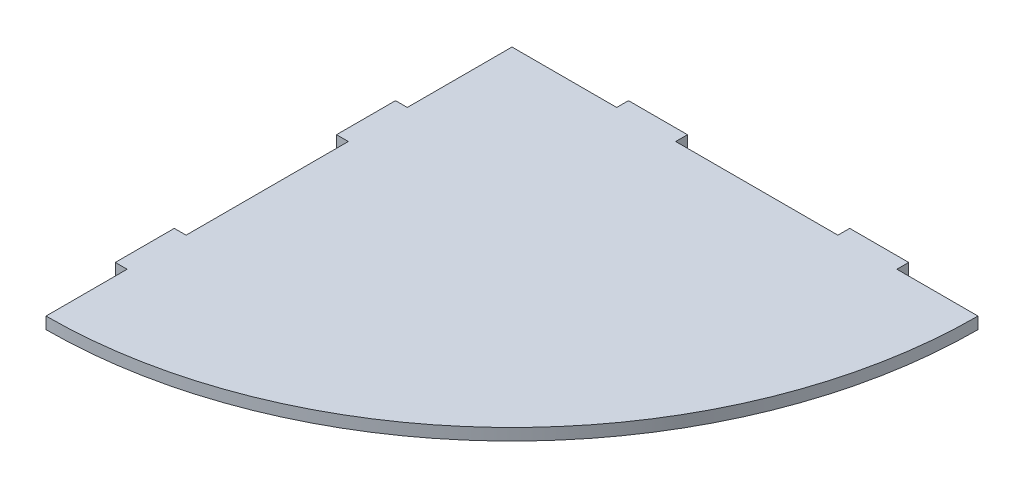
ISO-10303-21;
HEADER;
FILE_DESCRIPTION(('STEP AP214'),'2;1');
FILE_NAME('part.step','',(''),(''),'','','');
FILE_SCHEMA(('AUTOMOTIVE_DESIGN { 1 0 10303 214 1 1 1 1 }'));
ENDSEC;
DATA;
#1=APPLICATION_CONTEXT('core data for automotive mechanical design processes');
#2=APPLICATION_PROTOCOL_DEFINITION('international standard','automotive_design',2000,#1);
#3=PRODUCT_CONTEXT('',#1,'mechanical');
#4=PRODUCT('Part','Part','',(#3));
#5=PRODUCT_RELATED_PRODUCT_CATEGORY('part','',(#4));
#6=PRODUCT_DEFINITION_FORMATION('','',#4);
#7=PRODUCT_DEFINITION_CONTEXT('part definition',#1,'design');
#8=PRODUCT_DEFINITION('design','',#6,#7);
#9=PRODUCT_DEFINITION_SHAPE('','',#8);
#10=(LENGTH_UNIT() NAMED_UNIT(*) SI_UNIT(.MILLI.,.METRE.));
#11=(NAMED_UNIT(*) PLANE_ANGLE_UNIT() SI_UNIT($,.RADIAN.));
#12=(NAMED_UNIT(*) SI_UNIT($,.STERADIAN.) SOLID_ANGLE_UNIT());
#13=UNCERTAINTY_MEASURE_WITH_UNIT(LENGTH_MEASURE(1.E-05),#10,'distance_accuracy_value','');
#14=(GEOMETRIC_REPRESENTATION_CONTEXT(3) GLOBAL_UNCERTAINTY_ASSIGNED_CONTEXT((#13)) GLOBAL_UNIT_ASSIGNED_CONTEXT((#10,
#11,#12)) REPRESENTATION_CONTEXT('',''));
#15=CARTESIAN_POINT('',(0.,0.,0.));
#16=DIRECTION('',(0.,0.,1.));
#17=DIRECTION('',(1.,0.,0.));
#18=AXIS2_PLACEMENT_3D('',#15,#16,#17);
#19=CARTESIAN_POINT('',(0.,4.,0.));
#20=DIRECTION('',(0.,-1.,0.));
#21=DIRECTION('',(0.,0.,-1.));
#22=AXIS2_PLACEMENT_3D('',#19,#20,#21);
#23=CYLINDRICAL_SURFACE('',#22,158.);
#24=CARTESIAN_POINT('',(0.,0.,0.));
#25=DIRECTION('',(0.,1.,0.));
#26=DIRECTION('',(0.,0.,1.));
#27=AXIS2_PLACEMENT_3D('',#24,#25,#26);
#28=CIRCLE('',#27,158.);
#29=CARTESIAN_POINT('',(158.,0.,0.));
#30=VERTEX_POINT('',#29);
#31=CARTESIAN_POINT('',(0.,0.,158.));
#32=VERTEX_POINT('',#31);
#33=EDGE_CURVE('E203',#30,#32,#28,.F.);
#34=ORIENTED_EDGE('',*,*,#33,.F.);
#35=DIRECTION('',(0.,-1.,0.));
#36=VECTOR('',#35,1.);
#37=CARTESIAN_POINT('',(158.,4.,0.));
#38=LINE('',#37,#36);
#39=CARTESIAN_POINT('',(158.,4.,0.));
#40=VERTEX_POINT('',#39);
#41=EDGE_CURVE('E11',#40,#30,#38,.T.);
#42=ORIENTED_EDGE('',*,*,#41,.F.);
#43=CARTESIAN_POINT('',(0.,4.,0.));
#44=DIRECTION('',(0.,1.,0.));
#45=DIRECTION('',(0.,0.,1.));
#46=AXIS2_PLACEMENT_3D('',#43,#44,#45);
#47=CIRCLE('',#46,158.);
#48=CARTESIAN_POINT('',(0.,4.,158.));
#49=VERTEX_POINT('',#48);
#50=EDGE_CURVE('E249',#40,#49,#47,.F.);
#51=ORIENTED_EDGE('',*,*,#50,.T.);
#52=DIRECTION('',(0.,-1.,0.));
#53=VECTOR('',#52,1.);
#54=CARTESIAN_POINT('',(0.,4.,158.));
#55=LINE('',#54,#53);
#56=EDGE_CURVE('E129',#49,#32,#55,.T.);
#57=ORIENTED_EDGE('',*,*,#56,.T.);
#58=EDGE_LOOP('',(#34,#42,#51,#57));
#59=FACE_BOUND('',#58,.T.);
#60=ADVANCED_FACE('F45',(#59),#23,.T.);
#61=CARTESIAN_POINT('',(0.,4.,0.));
#62=DIRECTION('',(0.,0.,-1.));
#63=DIRECTION('',(-1.,0.,0.));
#64=AXIS2_PLACEMENT_3D('',#61,#62,#63);
#65=PLANE('',#64);
#66=DIRECTION('',(1.,0.,0.));
#67=VECTOR('',#66,1.);
#68=CARTESIAN_POINT('',(0.,0.,0.));
#69=LINE('',#68,#67);
#70=CARTESIAN_POINT('',(130.5,0.,0.));
#71=VERTEX_POINT('',#70);
#72=EDGE_CURVE('E206',#71,#30,#69,.T.);
#73=ORIENTED_EDGE('',*,*,#72,.F.);
#74=DIRECTION('',(0.,-1.,0.));
#75=VECTOR('',#74,1.);
#76=CARTESIAN_POINT('',(130.5,4.,0.));
#77=LINE('',#76,#75);
#78=CARTESIAN_POINT('',(130.5,4.,0.));
#79=VERTEX_POINT('',#78);
#80=EDGE_CURVE('E53',#79,#71,#77,.T.);
#81=ORIENTED_EDGE('',*,*,#80,.F.);
#82=DIRECTION('',(1.,0.,0.));
#83=VECTOR('',#82,1.);
#84=CARTESIAN_POINT('',(0.,4.,0.));
#85=LINE('',#84,#83);
#86=EDGE_CURVE('E305',#79,#40,#85,.T.);
#87=ORIENTED_EDGE('',*,*,#86,.T.);
#88=ORIENTED_EDGE('',*,*,#41,.T.);
#89=EDGE_LOOP('',(#73,#81,#87,#88));
#90=FACE_BOUND('',#89,.T.);
#91=ADVANCED_FACE('F293',(#90),#65,.T.);
#92=CARTESIAN_POINT('',(130.5,4.,0.));
#93=DIRECTION('',(1.,0.,0.));
#94=DIRECTION('',(0.,0.,-1.));
#95=AXIS2_PLACEMENT_3D('',#92,#93,#94);
#96=PLANE('',#95);
#97=DIRECTION('',(0.,0.,1.));
#98=VECTOR('',#97,1.);
#99=CARTESIAN_POINT('',(130.5,0.,0.));
#100=LINE('',#99,#98);
#101=CARTESIAN_POINT('',(130.5,0.,-4.));
#102=VERTEX_POINT('',#101);
#103=EDGE_CURVE('E209',#102,#71,#100,.T.);
#104=ORIENTED_EDGE('',*,*,#103,.F.);
#105=DIRECTION('',(0.,-1.,0.));
#106=VECTOR('',#105,1.);
#107=CARTESIAN_POINT('',(130.5,4.,-4.));
#108=LINE('',#107,#106);
#109=CARTESIAN_POINT('',(130.5,4.,-4.));
#110=VERTEX_POINT('',#109);
#111=EDGE_CURVE('E282',#110,#102,#108,.T.);
#112=ORIENTED_EDGE('',*,*,#111,.F.);
#113=DIRECTION('',(0.,0.,1.));
#114=VECTOR('',#113,1.);
#115=CARTESIAN_POINT('',(130.5,4.,0.));
#116=LINE('',#115,#114);
#117=EDGE_CURVE('E289',#110,#79,#116,.T.);
#118=ORIENTED_EDGE('',*,*,#117,.T.);
#119=ORIENTED_EDGE('',*,*,#80,.T.);
#120=EDGE_LOOP('',(#104,#112,#118,#119));
#121=FACE_BOUND('',#120,.T.);
#122=ADVANCED_FACE('F287',(#121),#96,.T.);
#123=CARTESIAN_POINT('',(0.,4.,-3.99999999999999));
#124=DIRECTION('',(0.,0.,-1.));
#125=DIRECTION('',(-1.,0.,0.));
#126=AXIS2_PLACEMENT_3D('',#123,#124,#125);
#127=PLANE('',#126);
#128=DIRECTION('',(1.,0.,0.));
#129=VECTOR('',#128,1.);
#130=CARTESIAN_POINT('',(0.,0.,-3.99999999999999));
#131=LINE('',#130,#129);
#132=CARTESIAN_POINT('',(110.5,0.,-4.));
#133=VERTEX_POINT('',#132);
#134=EDGE_CURVE('E212',#133,#102,#131,.T.);
#135=ORIENTED_EDGE('',*,*,#134,.F.);
#136=DIRECTION('',(0.,-1.,0.));
#137=VECTOR('',#136,1.);
#138=CARTESIAN_POINT('',(110.5,4.,-4.));
#139=LINE('',#138,#137);
#140=CARTESIAN_POINT('',(110.5,4.,-4.));
#141=VERTEX_POINT('',#140);
#142=EDGE_CURVE('E280',#141,#133,#139,.T.);
#143=ORIENTED_EDGE('',*,*,#142,.F.);
#144=DIRECTION('',(1.,0.,0.));
#145=VECTOR('',#144,1.);
#146=CARTESIAN_POINT('',(0.,4.,-3.99999999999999));
#147=LINE('',#146,#145);
#148=EDGE_CURVE('E302',#141,#110,#147,.T.);
#149=ORIENTED_EDGE('',*,*,#148,.T.);
#150=ORIENTED_EDGE('',*,*,#111,.T.);
#151=EDGE_LOOP('',(#135,#143,#149,#150));
#152=FACE_BOUND('',#151,.T.);
#153=ADVANCED_FACE('F299',(#152),#127,.T.);
#154=CARTESIAN_POINT('',(110.5,4.,0.));
#155=DIRECTION('',(-1.,0.,0.));
#156=DIRECTION('',(0.,0.,1.));
#157=AXIS2_PLACEMENT_3D('',#154,#155,#156);
#158=PLANE('',#157);
#159=DIRECTION('',(0.,0.,-1.));
#160=VECTOR('',#159,1.);
#161=CARTESIAN_POINT('',(110.5,0.,0.));
#162=LINE('',#161,#160);
#163=CARTESIAN_POINT('',(110.5,0.,0.));
#164=VERTEX_POINT('',#163);
#165=EDGE_CURVE('E215',#164,#133,#162,.T.);
#166=ORIENTED_EDGE('',*,*,#165,.F.);
#167=DIRECTION('',(0.,-1.,0.));
#168=VECTOR('',#167,1.);
#169=CARTESIAN_POINT('',(110.5,4.,0.));
#170=LINE('',#169,#168);
#171=CARTESIAN_POINT('',(110.5,4.,0.));
#172=VERTEX_POINT('',#171);
#173=EDGE_CURVE('E278',#172,#164,#170,.T.);
#174=ORIENTED_EDGE('',*,*,#173,.F.);
#175=DIRECTION('',(0.,0.,-1.));
#176=VECTOR('',#175,1.);
#177=CARTESIAN_POINT('',(110.5,4.,0.));
#178=LINE('',#177,#176);
#179=EDGE_CURVE('E307',#172,#141,#178,.T.);
#180=ORIENTED_EDGE('',*,*,#179,.T.);
#181=ORIENTED_EDGE('',*,*,#142,.T.);
#182=EDGE_LOOP('',(#166,#174,#180,#181));
#183=FACE_BOUND('',#182,.T.);
#184=ADVANCED_FACE('F361',(#183),#158,.T.);
#185=CARTESIAN_POINT('',(0.,4.,0.));
#186=DIRECTION('',(0.,0.,-1.));
#187=DIRECTION('',(-1.,0.,0.));
#188=AXIS2_PLACEMENT_3D('',#185,#186,#187);
#189=PLANE('',#188);
#190=DIRECTION('',(1.,0.,0.));
#191=VECTOR('',#190,1.);
#192=CARTESIAN_POINT('',(0.,0.,0.));
#193=LINE('',#192,#191);
#194=CARTESIAN_POINT('',(55.5,0.,0.));
#195=VERTEX_POINT('',#194);
#196=EDGE_CURVE('E218',#195,#164,#193,.T.);
#197=ORIENTED_EDGE('',*,*,#196,.F.);
#198=DIRECTION('',(0.,-1.,0.));
#199=VECTOR('',#198,1.);
#200=CARTESIAN_POINT('',(55.5,4.,0.));
#201=LINE('',#200,#199);
#202=CARTESIAN_POINT('',(55.5,4.,0.));
#203=VERTEX_POINT('',#202);
#204=EDGE_CURVE('E276',#203,#195,#201,.T.);
#205=ORIENTED_EDGE('',*,*,#204,.F.);
#206=DIRECTION('',(1.,0.,0.));
#207=VECTOR('',#206,1.);
#208=CARTESIAN_POINT('',(0.,4.,0.));
#209=LINE('',#208,#207);
#210=EDGE_CURVE('E313',#203,#172,#209,.T.);
#211=ORIENTED_EDGE('',*,*,#210,.T.);
#212=ORIENTED_EDGE('',*,*,#173,.T.);
#213=EDGE_LOOP('',(#197,#205,#211,#212));
#214=FACE_BOUND('',#213,.T.);
#215=ADVANCED_FACE('F364',(#214),#189,.T.);
#216=CARTESIAN_POINT('',(55.5,4.,0.));
#217=DIRECTION('',(1.,0.,0.));
#218=DIRECTION('',(0.,0.,-1.));
#219=AXIS2_PLACEMENT_3D('',#216,#217,#218);
#220=PLANE('',#219);
#221=DIRECTION('',(0.,0.,1.));
#222=VECTOR('',#221,1.);
#223=CARTESIAN_POINT('',(55.5,0.,0.));
#224=LINE('',#223,#222);
#225=CARTESIAN_POINT('',(55.5,0.,-4.));
#226=VERTEX_POINT('',#225);
#227=EDGE_CURVE('E221',#226,#195,#224,.T.);
#228=ORIENTED_EDGE('',*,*,#227,.F.);
#229=DIRECTION('',(0.,-1.,0.));
#230=VECTOR('',#229,1.);
#231=CARTESIAN_POINT('',(55.5,4.,-4.));
#232=LINE('',#231,#230);
#233=CARTESIAN_POINT('',(55.5,4.,-4.));
#234=VERTEX_POINT('',#233);
#235=EDGE_CURVE('E274',#234,#226,#232,.T.);
#236=ORIENTED_EDGE('',*,*,#235,.F.);
#237=DIRECTION('',(0.,0.,1.));
#238=VECTOR('',#237,1.);
#239=CARTESIAN_POINT('',(55.5,4.,0.));
#240=LINE('',#239,#238);
#241=EDGE_CURVE('E316',#234,#203,#240,.T.);
#242=ORIENTED_EDGE('',*,*,#241,.T.);
#243=ORIENTED_EDGE('',*,*,#204,.T.);
#244=EDGE_LOOP('',(#228,#236,#242,#243));
#245=FACE_BOUND('',#244,.T.);
#246=ADVANCED_FACE('F368',(#245),#220,.T.);
#247=CARTESIAN_POINT('',(0.,4.,-4.));
#248=DIRECTION('',(0.,0.,-1.));
#249=DIRECTION('',(-1.,0.,0.));
#250=AXIS2_PLACEMENT_3D('',#247,#248,#249);
#251=PLANE('',#250);
#252=DIRECTION('',(1.,0.,0.));
#253=VECTOR('',#252,1.);
#254=CARTESIAN_POINT('',(0.,0.,-4.));
#255=LINE('',#254,#253);
#256=CARTESIAN_POINT('',(35.5,0.,-4.));
#257=VERTEX_POINT('',#256);
#258=EDGE_CURVE('E224',#257,#226,#255,.T.);
#259=ORIENTED_EDGE('',*,*,#258,.F.);
#260=DIRECTION('',(0.,-1.,0.));
#261=VECTOR('',#260,1.);
#262=CARTESIAN_POINT('',(35.5,4.,-4.));
#263=LINE('',#262,#261);
#264=CARTESIAN_POINT('',(35.5,4.,-4.));
#265=VERTEX_POINT('',#264);
#266=EDGE_CURVE('E272',#265,#257,#263,.T.);
#267=ORIENTED_EDGE('',*,*,#266,.F.);
#268=DIRECTION('',(1.,0.,0.));
#269=VECTOR('',#268,1.);
#270=CARTESIAN_POINT('',(0.,4.,-4.));
#271=LINE('',#270,#269);
#272=EDGE_CURVE('E319',#265,#234,#271,.T.);
#273=ORIENTED_EDGE('',*,*,#272,.T.);
#274=ORIENTED_EDGE('',*,*,#235,.T.);
#275=EDGE_LOOP('',(#259,#267,#273,#274));
#276=FACE_BOUND('',#275,.T.);
#277=ADVANCED_FACE('F372',(#276),#251,.T.);
#278=CARTESIAN_POINT('',(35.5,4.,0.));
#279=DIRECTION('',(-1.,0.,0.));
#280=DIRECTION('',(0.,0.,1.));
#281=AXIS2_PLACEMENT_3D('',#278,#279,#280);
#282=PLANE('',#281);
#283=DIRECTION('',(0.,0.,-1.));
#284=VECTOR('',#283,1.);
#285=CARTESIAN_POINT('',(35.5,0.,0.));
#286=LINE('',#285,#284);
#287=CARTESIAN_POINT('',(35.5,0.,0.));
#288=VERTEX_POINT('',#287);
#289=EDGE_CURVE('E227',#288,#257,#286,.T.);
#290=ORIENTED_EDGE('',*,*,#289,.F.);
#291=DIRECTION('',(0.,-1.,0.));
#292=VECTOR('',#291,1.);
#293=CARTESIAN_POINT('',(35.5,4.,0.));
#294=LINE('',#293,#292);
#295=CARTESIAN_POINT('',(35.5,4.,0.));
#296=VERTEX_POINT('',#295);
#297=EDGE_CURVE('E270',#296,#288,#294,.T.);
#298=ORIENTED_EDGE('',*,*,#297,.F.);
#299=DIRECTION('',(0.,0.,-1.));
#300=VECTOR('',#299,1.);
#301=CARTESIAN_POINT('',(35.5,4.,0.));
#302=LINE('',#301,#300);
#303=EDGE_CURVE('E322',#296,#265,#302,.T.);
#304=ORIENTED_EDGE('',*,*,#303,.T.);
#305=ORIENTED_EDGE('',*,*,#266,.T.);
#306=EDGE_LOOP('',(#290,#298,#304,#305));
#307=FACE_BOUND('',#306,.T.);
#308=ADVANCED_FACE('F376',(#307),#282,.T.);
#309=CARTESIAN_POINT('',(0.,4.,0.));
#310=DIRECTION('',(0.,0.,-1.));
#311=DIRECTION('',(-1.,0.,0.));
#312=AXIS2_PLACEMENT_3D('',#309,#310,#311);
#313=PLANE('',#312);
#314=DIRECTION('',(1.,0.,0.));
#315=VECTOR('',#314,1.);
#316=CARTESIAN_POINT('',(0.,0.,0.));
#317=LINE('',#316,#315);
#318=CARTESIAN_POINT('',(0.,0.,0.));
#319=VERTEX_POINT('',#318);
#320=EDGE_CURVE('E230',#319,#288,#317,.T.);
#321=ORIENTED_EDGE('',*,*,#320,.F.);
#322=DIRECTION('',(0.,-1.,0.));
#323=VECTOR('',#322,1.);
#324=CARTESIAN_POINT('',(0.,4.,0.));
#325=LINE('',#324,#323);
#326=CARTESIAN_POINT('',(0.,4.,0.));
#327=VERTEX_POINT('',#326);
#328=EDGE_CURVE('E268',#327,#319,#325,.T.);
#329=ORIENTED_EDGE('',*,*,#328,.F.);
#330=DIRECTION('',(1.,0.,0.));
#331=VECTOR('',#330,1.);
#332=CARTESIAN_POINT('',(0.,4.,0.));
#333=LINE('',#332,#331);
#334=EDGE_CURVE('E325',#327,#296,#333,.T.);
#335=ORIENTED_EDGE('',*,*,#334,.T.);
#336=ORIENTED_EDGE('',*,*,#297,.T.);
#337=EDGE_LOOP('',(#321,#329,#335,#336));
#338=FACE_BOUND('',#337,.T.);
#339=ADVANCED_FACE('F380',(#338),#313,.T.);
#340=CARTESIAN_POINT('',(0.,4.,0.));
#341=DIRECTION('',(1.,0.,0.));
#342=DIRECTION('',(0.,0.,-1.));
#343=AXIS2_PLACEMENT_3D('',#340,#341,#342);
#344=PLANE('',#343);
#345=DIRECTION('',(0.,0.,1.));
#346=VECTOR('',#345,1.);
#347=CARTESIAN_POINT('',(0.,0.,0.));
#348=LINE('',#347,#346);
#349=CARTESIAN_POINT('',(0.,0.,35.5));
#350=VERTEX_POINT('',#349);
#351=EDGE_CURVE('E233',#319,#350,#348,.T.);
#352=ORIENTED_EDGE('',*,*,#351,.T.);
#353=DIRECTION('',(0.,-1.,0.));
#354=VECTOR('',#353,1.);
#355=CARTESIAN_POINT('',(0.,4.,35.5));
#356=LINE('',#355,#354);
#357=CARTESIAN_POINT('',(0.,4.,35.5));
#358=VERTEX_POINT('',#357);
#359=EDGE_CURVE('E265',#358,#350,#356,.T.);
#360=ORIENTED_EDGE('',*,*,#359,.F.);
#361=DIRECTION('',(0.,0.,1.));
#362=VECTOR('',#361,1.);
#363=CARTESIAN_POINT('',(0.,4.,0.));
#364=LINE('',#363,#362);
#365=EDGE_CURVE('E328',#327,#358,#364,.T.);
#366=ORIENTED_EDGE('',*,*,#365,.F.);
#367=ORIENTED_EDGE('',*,*,#328,.T.);
#368=EDGE_LOOP('',(#352,#360,#366,#367));
#369=FACE_BOUND('',#368,.T.);
#370=ADVANCED_FACE('F384',(#369),#344,.F.);
#371=CARTESIAN_POINT('',(0.,4.,35.5));
#372=DIRECTION('',(0.,0.,1.));
#373=DIRECTION('',(1.,0.,0.));
#374=AXIS2_PLACEMENT_3D('',#371,#372,#373);
#375=PLANE('',#374);
#376=DIRECTION('',(-1.,0.,0.));
#377=VECTOR('',#376,1.);
#378=CARTESIAN_POINT('',(0.,0.,35.5));
#379=LINE('',#378,#377);
#380=CARTESIAN_POINT('',(-3.99999999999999,0.,35.5));
#381=VERTEX_POINT('',#380);
#382=EDGE_CURVE('E235',#350,#381,#379,.T.);
#383=ORIENTED_EDGE('',*,*,#382,.T.);
#384=DIRECTION('',(0.,-1.,0.));
#385=VECTOR('',#384,1.);
#386=CARTESIAN_POINT('',(-3.99999999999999,4.,35.5));
#387=LINE('',#386,#385);
#388=CARTESIAN_POINT('',(-3.99999999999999,4.,35.5));
#389=VERTEX_POINT('',#388);
#390=EDGE_CURVE('E262',#389,#381,#387,.T.);
#391=ORIENTED_EDGE('',*,*,#390,.F.);
#392=DIRECTION('',(-1.,0.,0.));
#393=VECTOR('',#392,1.);
#394=CARTESIAN_POINT('',(0.,4.,35.5));
#395=LINE('',#394,#393);
#396=EDGE_CURVE('E330',#358,#389,#395,.T.);
#397=ORIENTED_EDGE('',*,*,#396,.F.);
#398=ORIENTED_EDGE('',*,*,#359,.T.);
#399=EDGE_LOOP('',(#383,#391,#397,#398));
#400=FACE_BOUND('',#399,.T.);
#401=ADVANCED_FACE('F388',(#400),#375,.F.);
#402=CARTESIAN_POINT('',(-3.99999999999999,4.,0.));
#403=DIRECTION('',(1.,0.,0.));
#404=DIRECTION('',(0.,0.,-1.));
#405=AXIS2_PLACEMENT_3D('',#402,#403,#404);
#406=PLANE('',#405);
#407=DIRECTION('',(0.,0.,1.));
#408=VECTOR('',#407,1.);
#409=CARTESIAN_POINT('',(-3.99999999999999,0.,0.));
#410=LINE('',#409,#408);
#411=CARTESIAN_POINT('',(-3.99999999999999,0.,55.5));
#412=VERTEX_POINT('',#411);
#413=EDGE_CURVE('E237',#381,#412,#410,.T.);
#414=ORIENTED_EDGE('',*,*,#413,.T.);
#415=DIRECTION('',(0.,-1.,0.));
#416=VECTOR('',#415,1.);
#417=CARTESIAN_POINT('',(-3.99999999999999,4.,55.5));
#418=LINE('',#417,#416);
#419=CARTESIAN_POINT('',(-3.99999999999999,4.,55.5));
#420=VERTEX_POINT('',#419);
#421=EDGE_CURVE('E259',#420,#412,#418,.T.);
#422=ORIENTED_EDGE('',*,*,#421,.F.);
#423=DIRECTION('',(0.,0.,1.));
#424=VECTOR('',#423,1.);
#425=CARTESIAN_POINT('',(-3.99999999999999,4.,0.));
#426=LINE('',#425,#424);
#427=EDGE_CURVE('E332',#389,#420,#426,.T.);
#428=ORIENTED_EDGE('',*,*,#427,.F.);
#429=ORIENTED_EDGE('',*,*,#390,.T.);
#430=EDGE_LOOP('',(#414,#422,#428,#429));
#431=FACE_BOUND('',#430,.T.);
#432=ADVANCED_FACE('F392',(#431),#406,.F.);
#433=CARTESIAN_POINT('',(0.,4.,55.5));
#434=DIRECTION('',(0.,0.,-1.));
#435=DIRECTION('',(-1.,0.,0.));
#436=AXIS2_PLACEMENT_3D('',#433,#434,#435);
#437=PLANE('',#436);
#438=DIRECTION('',(1.,0.,0.));
#439=VECTOR('',#438,1.);
#440=CARTESIAN_POINT('',(0.,0.,55.5));
#441=LINE('',#440,#439);
#442=CARTESIAN_POINT('',(0.,0.,55.5));
#443=VERTEX_POINT('',#442);
#444=EDGE_CURVE('E239',#412,#443,#441,.T.);
#445=ORIENTED_EDGE('',*,*,#444,.T.);
#446=DIRECTION('',(0.,-1.,0.));
#447=VECTOR('',#446,1.);
#448=CARTESIAN_POINT('',(0.,4.,55.5));
#449=LINE('',#448,#447);
#450=CARTESIAN_POINT('',(0.,4.,55.5));
#451=VERTEX_POINT('',#450);
#452=EDGE_CURVE('E256',#451,#443,#449,.T.);
#453=ORIENTED_EDGE('',*,*,#452,.F.);
#454=DIRECTION('',(1.,0.,0.));
#455=VECTOR('',#454,1.);
#456=CARTESIAN_POINT('',(0.,4.,55.5));
#457=LINE('',#456,#455);
#458=EDGE_CURVE('E334',#420,#451,#457,.T.);
#459=ORIENTED_EDGE('',*,*,#458,.F.);
#460=ORIENTED_EDGE('',*,*,#421,.T.);
#461=EDGE_LOOP('',(#445,#453,#459,#460));
#462=FACE_BOUND('',#461,.T.);
#463=ADVANCED_FACE('F396',(#462),#437,.F.);
#464=CARTESIAN_POINT('',(0.,4.,0.));
#465=DIRECTION('',(1.,0.,0.));
#466=DIRECTION('',(0.,0.,-1.));
#467=AXIS2_PLACEMENT_3D('',#464,#465,#466);
#468=PLANE('',#467);
#469=DIRECTION('',(0.,0.,1.));
#470=VECTOR('',#469,1.);
#471=CARTESIAN_POINT('',(0.,0.,0.));
#472=LINE('',#471,#470);
#473=CARTESIAN_POINT('',(0.,0.,110.5));
#474=VERTEX_POINT('',#473);
#475=EDGE_CURVE('E241',#443,#474,#472,.T.);
#476=ORIENTED_EDGE('',*,*,#475,.T.);
#477=DIRECTION('',(0.,-1.,0.));
#478=VECTOR('',#477,1.);
#479=CARTESIAN_POINT('',(0.,4.,110.5));
#480=LINE('',#479,#478);
#481=CARTESIAN_POINT('',(0.,4.,110.5));
#482=VERTEX_POINT('',#481);
#483=EDGE_CURVE('E253',#482,#474,#480,.T.);
#484=ORIENTED_EDGE('',*,*,#483,.F.);
#485=DIRECTION('',(0.,0.,1.));
#486=VECTOR('',#485,1.);
#487=CARTESIAN_POINT('',(0.,4.,0.));
#488=LINE('',#487,#486);
#489=EDGE_CURVE('E336',#451,#482,#488,.T.);
#490=ORIENTED_EDGE('',*,*,#489,.F.);
#491=ORIENTED_EDGE('',*,*,#452,.T.);
#492=EDGE_LOOP('',(#476,#484,#490,#491));
#493=FACE_BOUND('',#492,.T.);
#494=ADVANCED_FACE('F342',(#493),#468,.F.);
#495=CARTESIAN_POINT('',(0.,4.,110.5));
#496=DIRECTION('',(0.,0.,1.));
#497=DIRECTION('',(1.,0.,0.));
#498=AXIS2_PLACEMENT_3D('',#495,#496,#497);
#499=PLANE('',#498);
#500=DIRECTION('',(-1.,0.,0.));
#501=VECTOR('',#500,1.);
#502=CARTESIAN_POINT('',(0.,0.,110.5));
#503=LINE('',#502,#501);
#504=CARTESIAN_POINT('',(-3.99999999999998,0.,110.5));
#505=VERTEX_POINT('',#504);
#506=EDGE_CURVE('E243',#474,#505,#503,.T.);
#507=ORIENTED_EDGE('',*,*,#506,.T.);
#508=DIRECTION('',(0.,-1.,0.));
#509=VECTOR('',#508,1.);
#510=CARTESIAN_POINT('',(-3.99999999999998,4.,110.5));
#511=LINE('',#510,#509);
#512=CARTESIAN_POINT('',(-3.99999999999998,4.,110.5));
#513=VERTEX_POINT('',#512);
#514=EDGE_CURVE('E195',#513,#505,#511,.T.);
#515=ORIENTED_EDGE('',*,*,#514,.F.);
#516=DIRECTION('',(-1.,0.,0.));
#517=VECTOR('',#516,1.);
#518=CARTESIAN_POINT('',(0.,4.,110.5));
#519=LINE('',#518,#517);
#520=EDGE_CURVE('E186',#482,#513,#519,.T.);
#521=ORIENTED_EDGE('',*,*,#520,.F.);
#522=ORIENTED_EDGE('',*,*,#483,.T.);
#523=EDGE_LOOP('',(#507,#515,#521,#522));
#524=FACE_BOUND('',#523,.T.);
#525=ADVANCED_FACE('F346',(#524),#499,.F.);
#526=CARTESIAN_POINT('',(-3.99999999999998,4.,0.));
#527=DIRECTION('',(1.,0.,0.));
#528=DIRECTION('',(0.,0.,-1.));
#529=AXIS2_PLACEMENT_3D('',#526,#527,#528);
#530=PLANE('',#529);
#531=DIRECTION('',(0.,0.,1.));
#532=VECTOR('',#531,1.);
#533=CARTESIAN_POINT('',(-3.99999999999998,0.,0.));
#534=LINE('',#533,#532);
#535=CARTESIAN_POINT('',(-3.99999999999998,0.,130.5));
#536=VERTEX_POINT('',#535);
#537=EDGE_CURVE('E194',#505,#536,#534,.T.);
#538=ORIENTED_EDGE('',*,*,#537,.T.);
#539=DIRECTION('',(0.,-1.,0.));
#540=VECTOR('',#539,1.);
#541=CARTESIAN_POINT('',(-3.99999999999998,4.,130.5));
#542=LINE('',#541,#540);
#543=CARTESIAN_POINT('',(-3.99999999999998,4.,130.5));
#544=VERTEX_POINT('',#543);
#545=EDGE_CURVE('E191',#544,#536,#542,.T.);
#546=ORIENTED_EDGE('',*,*,#545,.F.);
#547=DIRECTION('',(0.,0.,1.));
#548=VECTOR('',#547,1.);
#549=CARTESIAN_POINT('',(-3.99999999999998,4.,0.));
#550=LINE('',#549,#548);
#551=EDGE_CURVE('E180',#513,#544,#550,.T.);
#552=ORIENTED_EDGE('',*,*,#551,.F.);
#553=ORIENTED_EDGE('',*,*,#514,.T.);
#554=EDGE_LOOP('',(#538,#546,#552,#553));
#555=FACE_BOUND('',#554,.T.);
#556=ADVANCED_FACE('F192',(#555),#530,.F.);
#557=CARTESIAN_POINT('',(0.,4.,130.5));
#558=DIRECTION('',(0.,0.,-1.));
#559=DIRECTION('',(-1.,0.,0.));
#560=AXIS2_PLACEMENT_3D('',#557,#558,#559);
#561=PLANE('',#560);
#562=DIRECTION('',(1.,0.,0.));
#563=VECTOR('',#562,1.);
#564=CARTESIAN_POINT('',(0.,0.,130.5));
#565=LINE('',#564,#563);
#566=CARTESIAN_POINT('',(0.,0.,130.5));
#567=VERTEX_POINT('',#566);
#568=EDGE_CURVE('E122',#536,#567,#565,.T.);
#569=ORIENTED_EDGE('',*,*,#568,.T.);
#570=DIRECTION('',(0.,-1.,0.));
#571=VECTOR('',#570,1.);
#572=CARTESIAN_POINT('',(0.,4.,130.5));
#573=LINE('',#572,#571);
#574=CARTESIAN_POINT('',(0.,4.,130.5));
#575=VERTEX_POINT('',#574);
#576=EDGE_CURVE('E196',#575,#567,#573,.T.);
#577=ORIENTED_EDGE('',*,*,#576,.F.);
#578=DIRECTION('',(1.,0.,0.));
#579=VECTOR('',#578,1.);
#580=CARTESIAN_POINT('',(0.,4.,130.5));
#581=LINE('',#580,#579);
#582=EDGE_CURVE('E184',#544,#575,#581,.T.);
#583=ORIENTED_EDGE('',*,*,#582,.F.);
#584=ORIENTED_EDGE('',*,*,#545,.T.);
#585=EDGE_LOOP('',(#569,#577,#583,#584));
#586=FACE_BOUND('',#585,.T.);
#587=ADVANCED_FACE('F198',(#586),#561,.F.);
#588=CARTESIAN_POINT('',(0.,4.,0.));
#589=DIRECTION('',(1.,0.,0.));
#590=DIRECTION('',(0.,0.,-1.));
#591=AXIS2_PLACEMENT_3D('',#588,#589,#590);
#592=PLANE('',#591);
#593=DIRECTION('',(0.,0.,1.));
#594=VECTOR('',#593,1.);
#595=CARTESIAN_POINT('',(0.,0.,0.));
#596=LINE('',#595,#594);
#597=EDGE_CURVE('E247',#567,#32,#596,.T.);
#598=ORIENTED_EDGE('',*,*,#597,.T.);
#599=ORIENTED_EDGE('',*,*,#56,.F.);
#600=DIRECTION('',(0.,0.,1.));
#601=VECTOR('',#600,1.);
#602=CARTESIAN_POINT('',(0.,4.,0.));
#603=LINE('',#602,#601);
#604=EDGE_CURVE('E61',#575,#49,#603,.T.);
#605=ORIENTED_EDGE('',*,*,#604,.F.);
#606=ORIENTED_EDGE('',*,*,#576,.T.);
#607=EDGE_LOOP('',(#598,#599,#605,#606));
#608=FACE_BOUND('',#607,.T.);
#609=ADVANCED_FACE('F349',(#608),#592,.F.);
#610=CARTESIAN_POINT('',(0.,4.,0.));
#611=DIRECTION('',(0.,1.,0.));
#612=DIRECTION('',(0.,0.,1.));
#613=AXIS2_PLACEMENT_3D('',#610,#611,#612);
#614=PLANE('',#613);
#615=ORIENTED_EDGE('',*,*,#50,.F.);
#616=ORIENTED_EDGE('',*,*,#86,.F.);
#617=ORIENTED_EDGE('',*,*,#117,.F.);
#618=ORIENTED_EDGE('',*,*,#148,.F.);
#619=ORIENTED_EDGE('',*,*,#179,.F.);
#620=ORIENTED_EDGE('',*,*,#210,.F.);
#621=ORIENTED_EDGE('',*,*,#241,.F.);
#622=ORIENTED_EDGE('',*,*,#272,.F.);
#623=ORIENTED_EDGE('',*,*,#303,.F.);
#624=ORIENTED_EDGE('',*,*,#334,.F.);
#625=ORIENTED_EDGE('',*,*,#365,.T.);
#626=ORIENTED_EDGE('',*,*,#396,.T.);
#627=ORIENTED_EDGE('',*,*,#427,.T.);
#628=ORIENTED_EDGE('',*,*,#458,.T.);
#629=ORIENTED_EDGE('',*,*,#489,.T.);
#630=ORIENTED_EDGE('',*,*,#520,.T.);
#631=ORIENTED_EDGE('',*,*,#551,.T.);
#632=ORIENTED_EDGE('',*,*,#582,.T.);
#633=ORIENTED_EDGE('',*,*,#604,.T.);
#634=EDGE_LOOP('',(#615,#616,#617,#618,#619,#620,#621,#622,#623,#624,#625,#626,#627,#628,#629,
#630,#631,#632,#633));
#635=FACE_BOUND('',#634,.T.);
#636=ADVANCED_FACE('F182',(#635),#614,.T.);
#637=CARTESIAN_POINT('',(0.,0.,0.));
#638=DIRECTION('',(0.,1.,0.));
#639=DIRECTION('',(0.,0.,1.));
#640=AXIS2_PLACEMENT_3D('',#637,#638,#639);
#641=PLANE('',#640);
#642=ORIENTED_EDGE('',*,*,#33,.T.);
#643=ORIENTED_EDGE('',*,*,#597,.F.);
#644=ORIENTED_EDGE('',*,*,#568,.F.);
#645=ORIENTED_EDGE('',*,*,#537,.F.);
#646=ORIENTED_EDGE('',*,*,#506,.F.);
#647=ORIENTED_EDGE('',*,*,#475,.F.);
#648=ORIENTED_EDGE('',*,*,#444,.F.);
#649=ORIENTED_EDGE('',*,*,#413,.F.);
#650=ORIENTED_EDGE('',*,*,#382,.F.);
#651=ORIENTED_EDGE('',*,*,#351,.F.);
#652=ORIENTED_EDGE('',*,*,#320,.T.);
#653=ORIENTED_EDGE('',*,*,#289,.T.);
#654=ORIENTED_EDGE('',*,*,#258,.T.);
#655=ORIENTED_EDGE('',*,*,#227,.T.);
#656=ORIENTED_EDGE('',*,*,#196,.T.);
#657=ORIENTED_EDGE('',*,*,#165,.T.);
#658=ORIENTED_EDGE('',*,*,#134,.T.);
#659=ORIENTED_EDGE('',*,*,#103,.T.);
#660=ORIENTED_EDGE('',*,*,#72,.T.);
#661=EDGE_LOOP('',(#642,#643,#644,#645,#646,#647,#648,#649,#650,#651,#652,#653,#654,#655,#656,
#657,#658,#659,#660));
#662=FACE_BOUND('',#661,.T.);
#663=ADVANCED_FACE('F295',(#662),#641,.F.);
#664=CLOSED_SHELL('',(#60,#91,#122,#153,#184,#215,#246,#277,#308,#339,#370,#401,#432,#463,#494,
#525,#556,#587,#609,#636,#663));
#665=MANIFOLD_SOLID_BREP('B2',#664);
#666=ADVANCED_BREP_SHAPE_REPRESENTATION('',(#18,#665),#14);
#667=SHAPE_DEFINITION_REPRESENTATION(#9,#666);
ENDSEC;
END-ISO-10303-21;
